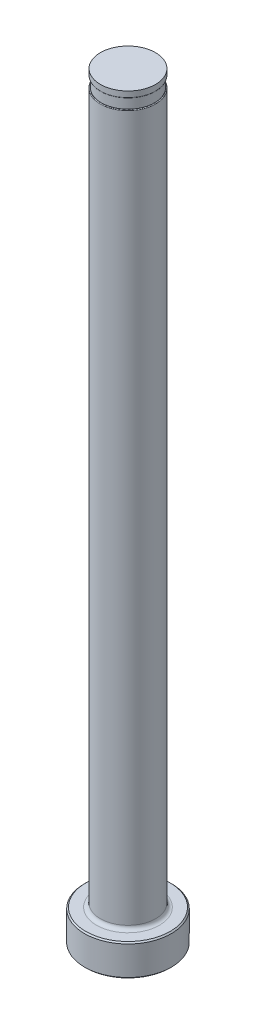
ISO-10303-21;
HEADER;
FILE_DESCRIPTION(('STEP AP214'),'2;1');
FILE_NAME('part.step','',(''),(''),'','','');
FILE_SCHEMA(('AUTOMOTIVE_DESIGN { 1 0 10303 214 1 1 1 1 }'));
ENDSEC;
DATA;
#1=APPLICATION_CONTEXT('core data for automotive mechanical design processes');
#2=APPLICATION_PROTOCOL_DEFINITION('international standard','automotive_design',2000,#1);
#3=PRODUCT_CONTEXT('',#1,'mechanical');
#4=PRODUCT('Part','Part','',(#3));
#5=PRODUCT_RELATED_PRODUCT_CATEGORY('part','',(#4));
#6=PRODUCT_DEFINITION_FORMATION('','',#4);
#7=PRODUCT_DEFINITION_CONTEXT('part definition',#1,'design');
#8=PRODUCT_DEFINITION('design','',#6,#7);
#9=PRODUCT_DEFINITION_SHAPE('','',#8);
#10=(LENGTH_UNIT() NAMED_UNIT(*) SI_UNIT(.MILLI.,.METRE.));
#11=(NAMED_UNIT(*) PLANE_ANGLE_UNIT() SI_UNIT($,.RADIAN.));
#12=(NAMED_UNIT(*) SI_UNIT($,.STERADIAN.) SOLID_ANGLE_UNIT());
#13=UNCERTAINTY_MEASURE_WITH_UNIT(LENGTH_MEASURE(1.E-05),#10,'distance_accuracy_value','');
#14=(GEOMETRIC_REPRESENTATION_CONTEXT(3) GLOBAL_UNCERTAINTY_ASSIGNED_CONTEXT((#13)) GLOBAL_UNIT_ASSIGNED_CONTEXT((#10,
#11,#12)) REPRESENTATION_CONTEXT('',''));
#15=CARTESIAN_POINT('',(0.,0.,0.));
#16=DIRECTION('',(0.,0.,1.));
#17=DIRECTION('',(1.,0.,0.));
#18=AXIS2_PLACEMENT_3D('',#15,#16,#17);
#19=CARTESIAN_POINT('',(-5.55624999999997,151.13,0.));
#20=DIRECTION('',(0.,1.,0.));
#21=DIRECTION('',(0.,0.,1.));
#22=AXIS2_PLACEMENT_3D('',#19,#20,#21);
#23=PLANE('',#22);
#24=CARTESIAN_POINT('',(0.,151.13,0.));
#25=DIRECTION('',(0.,1.,0.));
#26=DIRECTION('',(0.,0.,1.));
#27=AXIS2_PLACEMENT_3D('',#24,#25,#26);
#28=CIRCLE('',#27,5.41654999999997);
#29=CARTESIAN_POINT('',(0.,151.13,5.41654999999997));
#30=VERTEX_POINT('',#29);
#31=EDGE_CURVE('E11',#30,#30,#28,.F.);
#32=ORIENTED_EDGE('',*,*,#31,.T.);
#33=EDGE_LOOP('',(#32));
#34=FACE_BOUND('',#33,.T.);
#35=CARTESIAN_POINT('',(0.,151.13,0.));
#36=DIRECTION('',(0.,1.,0.));
#37=DIRECTION('',(0.,0.,1.));
#38=AXIS2_PLACEMENT_3D('',#35,#36,#37);
#39=CIRCLE('',#38,5.35304999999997);
#40=CARTESIAN_POINT('',(0.,151.13,5.35304999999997));
#41=VERTEX_POINT('',#40);
#42=EDGE_CURVE('E78',#41,#41,#39,.T.);
#43=ORIENTED_EDGE('',*,*,#42,.T.);
#44=EDGE_LOOP('',(#43));
#45=FACE_BOUND('',#44,.T.);
#46=ADVANCED_FACE('F36',(#34,#45),#23,.F.);
#47=CARTESIAN_POINT('',(0.,259.958771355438,0.));
#48=DIRECTION('',(0.,1.,0.));
#49=DIRECTION('',(0.,0.,1.));
#50=AXIS2_PLACEMENT_3D('',#47,#48,#49);
#51=CYLINDRICAL_SURFACE('',#50,5.55624999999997);
#52=DIRECTION('',(0.,1.,0.));
#53=VECTOR('',#52,1.);
#54=CARTESIAN_POINT('',(-5.35304999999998,259.958771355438,-1.48888205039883));
#55=LINE('',#54,#53);
#56=CARTESIAN_POINT('',(-5.35304999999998,148.971,-1.48888205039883));
#57=VERTEX_POINT('',#56);
#58=CARTESIAN_POINT('',(-5.35304999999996,86.614,-1.48888205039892));
#59=VERTEX_POINT('',#58);
#60=EDGE_CURVE('E73',#57,#59,#55,.F.);
#61=ORIENTED_EDGE('',*,*,#60,.F.);
#62=CARTESIAN_POINT('',(0.,148.971,0.));
#63=DIRECTION('',(0.,-1.,0.));
#64=DIRECTION('',(0.,0.,-1.));
#65=AXIS2_PLACEMENT_3D('',#62,#63,#64);
#66=CIRCLE('',#65,5.55624999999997);
#67=CARTESIAN_POINT('',(-5.35304999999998,148.971,1.48888205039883));
#68=VERTEX_POINT('',#67);
#69=EDGE_CURVE('E51',#57,#68,#66,.T.);
#70=ORIENTED_EDGE('',*,*,#69,.T.);
#71=DIRECTION('',(0.,1.,0.));
#72=VECTOR('',#71,1.);
#73=CARTESIAN_POINT('',(-5.35304999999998,259.958771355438,1.48888205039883));
#74=LINE('',#73,#72);
#75=CARTESIAN_POINT('',(-5.35304999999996,86.614,1.48888205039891));
#76=VERTEX_POINT('',#75);
#77=EDGE_CURVE('E84',#76,#68,#74,.T.);
#78=ORIENTED_EDGE('',*,*,#77,.F.);
#79=CARTESIAN_POINT('',(-5.35304999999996,86.614,-1.48888205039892));
#80=CARTESIAN_POINT('',(-5.35304712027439,86.5859400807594,-1.48888592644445));
#81=CARTESIAN_POINT('',(-5.35342246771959,86.557898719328,-1.48754344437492));
#82=CARTESIAN_POINT('',(-5.35490012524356,86.5021072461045,-1.48221807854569));
#83=CARTESIAN_POINT('',(-5.3560019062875,86.4743569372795,-1.47823711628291));
#84=CARTESIAN_POINT('',(-5.36032637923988,86.3923774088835,-1.46251079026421));
#85=CARTESIAN_POINT('',(-5.36456936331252,86.338885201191,-1.44697968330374));
#86=CARTESIAN_POINT('',(-5.37522073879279,86.2358696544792,-1.40688871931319));
#87=CARTESIAN_POINT('',(-5.38162399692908,86.1863372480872,-1.38235025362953));
#88=CARTESIAN_POINT('',(-5.39588416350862,86.0920393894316,-1.3255962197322));
#89=CARTESIAN_POINT('',(-5.40374399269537,86.0472838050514,-1.29336518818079));
#90=CARTESIAN_POINT('',(-5.42234104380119,85.9520810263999,-1.21335067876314));
#91=CARTESIAN_POINT('',(-5.43329059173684,85.9032435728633,-1.16370716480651));
#92=CARTESIAN_POINT('',(-5.45504519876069,85.8143973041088,-1.05705847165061));
#93=CARTESIAN_POINT('',(-5.46585002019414,85.7744016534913,-1.0000425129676));
#94=CARTESIAN_POINT('',(-5.48941062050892,85.6922379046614,-0.862814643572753));
#95=CARTESIAN_POINT('',(-5.50177933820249,85.6530172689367,-0.780775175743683));
#96=CARTESIAN_POINT('',(-5.52319531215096,85.5880184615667,-0.61119833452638));
#97=CARTESIAN_POINT('',(-5.53224012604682,85.5622501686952,-0.523656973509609));
#98=CARTESIAN_POINT('',(-5.54633656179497,85.5229210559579,-0.343981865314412));
#99=CARTESIAN_POINT('',(-5.551315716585,85.5095811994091,-0.251794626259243));
#100=CARTESIAN_POINT('',(-5.55663041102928,85.4953656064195,-0.0663077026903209));
#101=CARTESIAN_POINT('',(-5.5569631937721,85.4944972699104,0.0269926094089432));
#102=CARTESIAN_POINT('',(-5.55261816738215,85.5060778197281,0.228128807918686));
#103=CARTESIAN_POINT('',(-5.5471061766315,85.5207433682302,0.335828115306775));
#104=CARTESIAN_POINT('',(-5.53028051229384,85.5677503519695,0.546872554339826));
#105=CARTESIAN_POINT('',(-5.51897217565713,85.60007552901,0.650221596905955));
#106=CARTESIAN_POINT('',(-5.49592210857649,85.6717771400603,0.81966257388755));
#107=CARTESIAN_POINT('',(-5.48524552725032,85.7064328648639,0.88790475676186));
#108=CARTESIAN_POINT('',(-5.46261932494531,85.7860662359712,1.01785270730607));
#109=CARTESIAN_POINT('',(-5.45067176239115,85.8310273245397,1.07956873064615));
#110=CARTESIAN_POINT('',(-5.42934912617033,85.9209408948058,1.18161350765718));
#111=CARTESIAN_POINT('',(-5.41996423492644,85.9638853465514,1.22370530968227));
#112=CARTESIAN_POINT('',(-5.40207756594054,86.0562163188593,1.30039205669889));
#113=CARTESIAN_POINT('',(-5.3935749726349,86.1055967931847,1.33499395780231));
#114=CARTESIAN_POINT('',(-5.37957377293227,86.2020291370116,1.39024779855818));
#115=CARTESIAN_POINT('',(-5.37381465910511,86.2482834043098,1.4122235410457));
#116=CARTESIAN_POINT('',(-5.36419527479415,86.3439194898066,1.44833565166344));
#117=CARTESIAN_POINT('',(-5.36033174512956,86.3932957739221,1.46248548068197));
#118=CARTESIAN_POINT('',(-5.3561211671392,86.4715749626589,1.47780624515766));
#119=CARTESIAN_POINT('',(-5.35497463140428,86.49988137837,1.48194947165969));
#120=CARTESIAN_POINT('',(-5.35343719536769,86.5567860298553,1.48749027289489));
#121=CARTESIAN_POINT('',(-5.35304641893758,86.5853843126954,1.4888873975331));
#122=CARTESIAN_POINT('',(-5.35304999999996,86.614,1.48888205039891));
#123=B_SPLINE_CURVE_WITH_KNOTS('',3,(#79,#80,#81,#82,#83,#84,#85,#86,#87,#88,#89,#90,#91,#92,
#93,#94,#95,#96,#97,#98,#99,#100,#101,#102,#103,#104,#105,#106,#107,#108,#109,#110,#111,#112,
#113,#114,#115,#116,#117,#118,#119,#120,#121,#122),.UNSPECIFIED.,.F.,.F.,(4,2,2,2,2,2,2,2,2,2,2,
2,2,2,2,2,2,2,2,2,2,4),(0.,0.0841097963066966,0.168158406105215,0.334679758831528,
0.50080817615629,0.667273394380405,0.87762078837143,1.0882792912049,1.36213137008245,
1.63618427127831,1.91502141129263,2.19402399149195,2.51897339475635,2.84362413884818,
3.07466463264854,3.30533648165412,3.48723774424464,3.66896933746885,3.82292542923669,
3.97661588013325,4.06237930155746,4.14815677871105),.UNSPECIFIED.);
#124=EDGE_CURVE('E81',#59,#76,#123,.T.);
#125=ORIENTED_EDGE('',*,*,#124,.F.);
#126=EDGE_LOOP('',(#61,#70,#78,#125));
#127=FACE_BOUND('',#126,.T.);
#128=CARTESIAN_POINT('',(0.,7.11200000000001,0.));
#129=DIRECTION('',(0.,1.,0.));
#130=DIRECTION('',(0.,0.,1.));
#131=AXIS2_PLACEMENT_3D('',#128,#129,#130);
#132=CIRCLE('',#131,5.55624999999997);
#133=CARTESIAN_POINT('',(0.,7.11200000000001,5.55624999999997));
#134=VERTEX_POINT('',#133);
#135=EDGE_CURVE('E116',#134,#134,#132,.T.);
#136=ORIENTED_EDGE('',*,*,#135,.T.);
#137=EDGE_LOOP('',(#136));
#138=FACE_BOUND('',#137,.T.);
#139=ADVANCED_FACE('F82',(#127,#138),#51,.T.);
#140=CARTESIAN_POINT('',(0.,0.,0.));
#141=DIRECTION('',(0.,-1.,0.));
#142=DIRECTION('',(0.,0.,-1.));
#143=AXIS2_PLACEMENT_3D('',#140,#141,#142);
#144=PLANE('',#143);
#145=CARTESIAN_POINT('',(0.,0.,0.));
#146=DIRECTION('',(0.,-1.,0.));
#147=DIRECTION('',(0.,0.,-1.));
#148=AXIS2_PLACEMENT_3D('',#145,#146,#147);
#149=CIRCLE('',#148,8.47089999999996);
#150=CARTESIAN_POINT('',(0.,0.,-8.47089999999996));
#151=VERTEX_POINT('',#150);
#152=EDGE_CURVE('E113',#151,#151,#149,.T.);
#153=ORIENTED_EDGE('',*,*,#152,.T.);
#154=EDGE_LOOP('',(#153));
#155=FACE_BOUND('',#154,.T.);
#156=ADVANCED_FACE('F192',(#155),#144,.T.);
#157=CARTESIAN_POINT('',(0.,259.958771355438,0.));
#158=DIRECTION('',(0.,1.,0.));
#159=DIRECTION('',(0.,0.,1.));
#160=AXIS2_PLACEMENT_3D('',#157,#158,#159);
#161=CYLINDRICAL_SURFACE('',#160,8.72489999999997);
#162=CARTESIAN_POINT('',(0.,6.09600000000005,0.));
#163=DIRECTION('',(0.,1.,0.));
#164=DIRECTION('',(0.,0.,1.));
#165=AXIS2_PLACEMENT_3D('',#162,#163,#164);
#166=CIRCLE('',#165,8.72489999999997);
#167=CARTESIAN_POINT('',(0.,6.09600000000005,8.72489999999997));
#168=VERTEX_POINT('',#167);
#169=EDGE_CURVE('E110',#168,#168,#166,.F.);
#170=ORIENTED_EDGE('',*,*,#169,.T.);
#171=EDGE_LOOP('',(#170));
#172=FACE_BOUND('',#171,.T.);
#173=CARTESIAN_POINT('',(0.,0.254000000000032,0.));
#174=DIRECTION('',(0.,-1.,0.));
#175=DIRECTION('',(0.,0.,-1.));
#176=AXIS2_PLACEMENT_3D('',#173,#174,#175);
#177=CIRCLE('',#176,8.72489999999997);
#178=CARTESIAN_POINT('',(0.,0.254000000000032,-8.72489999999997));
#179=VERTEX_POINT('',#178);
#180=EDGE_CURVE('E107',#179,#179,#177,.F.);
#181=ORIENTED_EDGE('',*,*,#180,.T.);
#182=EDGE_LOOP('',(#181));
#183=FACE_BOUND('',#182,.T.);
#184=ADVANCED_FACE('F195',(#172,#183),#161,.T.);
#185=CARTESIAN_POINT('',(-8.72489999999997,6.35,0.));
#186=DIRECTION('',(0.,1.,0.));
#187=DIRECTION('',(0.,0.,1.));
#188=AXIS2_PLACEMENT_3D('',#185,#186,#187);
#189=PLANE('',#188);
#190=CARTESIAN_POINT('',(0.,6.35,0.));
#191=DIRECTION('',(0.,1.,0.));
#192=DIRECTION('',(0.,0.,1.));
#193=AXIS2_PLACEMENT_3D('',#190,#191,#192);
#194=CIRCLE('',#193,6.31824999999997);
#195=CARTESIAN_POINT('',(0.,6.35,6.31824999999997));
#196=VERTEX_POINT('',#195);
#197=EDGE_CURVE('E87',#196,#196,#194,.F.);
#198=ORIENTED_EDGE('',*,*,#197,.T.);
#199=EDGE_LOOP('',(#198));
#200=FACE_BOUND('',#199,.T.);
#201=CARTESIAN_POINT('',(0.,6.35,0.));
#202=DIRECTION('',(0.,1.,0.));
#203=DIRECTION('',(0.,0.,1.));
#204=AXIS2_PLACEMENT_3D('',#201,#202,#203);
#205=CIRCLE('',#204,8.47090000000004);
#206=CARTESIAN_POINT('',(0.,6.35,8.47090000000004));
#207=VERTEX_POINT('',#206);
#208=EDGE_CURVE('E104',#207,#207,#205,.T.);
#209=ORIENTED_EDGE('',*,*,#208,.T.);
#210=EDGE_LOOP('',(#209));
#211=FACE_BOUND('',#210,.T.);
#212=ADVANCED_FACE('F190',(#200,#211),#189,.T.);
#213=CARTESIAN_POINT('',(0.,6.35000000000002,0.));
#214=DIRECTION('',(0.,-1.,0.));
#215=DIRECTION('',(0.,0.,-1.));
#216=AXIS2_PLACEMENT_3D('',#213,#214,#215);
#217=CONICAL_SURFACE('',#216,8.47090000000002,0.785398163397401);
#218=ORIENTED_EDGE('',*,*,#169,.F.);
#219=EDGE_LOOP('',(#218));
#220=FACE_BOUND('',#219,.T.);
#221=ORIENTED_EDGE('',*,*,#208,.F.);
#222=EDGE_LOOP('',(#221));
#223=FACE_BOUND('',#222,.T.);
#224=ADVANCED_FACE('F186',(#220,#223),#217,.T.);
#225=CARTESIAN_POINT('',(0.,0.254000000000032,0.));
#226=DIRECTION('',(0.,1.,0.));
#227=DIRECTION('',(0.,0.,1.));
#228=AXIS2_PLACEMENT_3D('',#225,#226,#227);
#229=CONICAL_SURFACE('',#228,8.72489999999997,0.785398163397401);
#230=ORIENTED_EDGE('',*,*,#152,.F.);
#231=EDGE_LOOP('',(#230));
#232=FACE_BOUND('',#231,.T.);
#233=ORIENTED_EDGE('',*,*,#180,.F.);
#234=EDGE_LOOP('',(#233));
#235=FACE_BOUND('',#234,.T.);
#236=ADVANCED_FACE('F182',(#232,#235),#229,.T.);
#237=CARTESIAN_POINT('',(0.,7.11200000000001,0.));
#238=DIRECTION('',(0.,1.,0.));
#239=DIRECTION('',(0.,0.,1.));
#240=AXIS2_PLACEMENT_3D('',#237,#238,#239);
#241=TOROIDAL_SURFACE('',#240,6.31824999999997,0.762);
#242=ORIENTED_EDGE('',*,*,#197,.F.);
#243=EDGE_LOOP('',(#242));
#244=FACE_BOUND('',#243,.T.);
#245=ORIENTED_EDGE('',*,*,#135,.F.);
#246=EDGE_LOOP('',(#245));
#247=FACE_BOUND('',#246,.T.);
#248=ADVANCED_FACE('F147',(#244,#247),#241,.F.);
#249=CARTESIAN_POINT('',(-5.55624999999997,149.098,0.));
#250=DIRECTION('',(0.,-1.,0.));
#251=DIRECTION('',(0.,0.,-1.));
#252=AXIS2_PLACEMENT_3D('',#249,#250,#251);
#253=PLANE('',#252);
#254=DIRECTION('',(0.,0.,1.));
#255=VECTOR('',#254,1.);
#256=CARTESIAN_POINT('',(-5.35304999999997,149.098,0.));
#257=LINE('',#256,#255);
#258=CARTESIAN_POINT('',(-5.35304999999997,149.098,0.));
#259=VERTEX_POINT('',#258);
#260=CARTESIAN_POINT('',(-5.35304999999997,149.098,0.906427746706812));
#261=VERTEX_POINT('',#260);
#262=EDGE_CURVE('E90',#259,#261,#257,.T.);
#263=ORIENTED_EDGE('',*,*,#262,.T.);
#264=CARTESIAN_POINT('',(0.,149.098,0.));
#265=DIRECTION('',(0.,-1.,0.));
#266=DIRECTION('',(0.,0.,-1.));
#267=AXIS2_PLACEMENT_3D('',#264,#265,#266);
#268=CIRCLE('',#267,5.42924999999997);
#269=CARTESIAN_POINT('',(-5.35304999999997,149.098,-0.906427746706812));
#270=VERTEX_POINT('',#269);
#271=EDGE_CURVE('E86',#261,#270,#268,.F.);
#272=ORIENTED_EDGE('',*,*,#271,.T.);
#273=EDGE_CURVE('E79',#270,#259,#257,.T.);
#274=ORIENTED_EDGE('',*,*,#273,.T.);
#275=CARTESIAN_POINT('',(0.,149.098,0.));
#276=DIRECTION('',(0.,1.,0.));
#277=DIRECTION('',(0.,0.,1.));
#278=AXIS2_PLACEMENT_3D('',#275,#276,#277);
#279=CIRCLE('',#278,5.35304999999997);
#280=EDGE_CURVE('E101',#259,#259,#279,.T.);
#281=ORIENTED_EDGE('',*,*,#280,.F.);
#282=EDGE_LOOP('',(#263,#272,#274,#281));
#283=FACE_BOUND('',#282,.T.);
#284=ADVANCED_FACE('F144',(#283),#253,.F.);
#285=CARTESIAN_POINT('',(0.,153.448281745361,0.));
#286=DIRECTION('',(0.,1.,0.));
#287=DIRECTION('',(0.,0.,1.));
#288=AXIS2_PLACEMENT_3D('',#285,#286,#287);
#289=CYLINDRICAL_SURFACE('',#288,5.35304999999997);
#290=ORIENTED_EDGE('',*,*,#42,.F.);
#291=EDGE_LOOP('',(#290));
#292=FACE_BOUND('',#291,.T.);
#293=ORIENTED_EDGE('',*,*,#280,.T.);
#294=EDGE_LOOP('',(#293));
#295=FACE_BOUND('',#294,.T.);
#296=ADVANCED_FACE('F141',(#292,#295),#289,.T.);
#297=CARTESIAN_POINT('',(-5.35304999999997,150.114,-8.72489999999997));
#298=DIRECTION('',(1.,0.,0.));
#299=DIRECTION('',(0.,1.,0.));
#300=AXIS2_PLACEMENT_3D('',#297,#298,#299);
#301=PLANE('',#300);
#302=ORIENTED_EDGE('',*,*,#273,.F.);
#303=CARTESIAN_POINT('',(-5.35304999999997,149.098,-0.906427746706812));
#304=CARTESIAN_POINT('',(-5.35304999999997,149.097997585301,-0.927323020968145));
#305=CARTESIAN_POINT('',(-5.35304999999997,149.097856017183,-0.94821957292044));
#306=CARTESIAN_POINT('',(-5.35304999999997,149.097220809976,-0.990022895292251));
#307=CARTESIAN_POINT('',(-5.35304999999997,149.09672690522,-1.01092966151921));
#308=CARTESIAN_POINT('',(-5.35304999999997,149.095293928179,-1.05329459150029));
#309=CARTESIAN_POINT('',(-5.35304999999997,149.094343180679,-1.07475238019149));
#310=CARTESIAN_POINT('',(-5.35304999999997,149.091886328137,-1.11762595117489));
#311=CARTESIAN_POINT('',(-5.35304999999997,149.090380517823,-1.13904174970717));
#312=CARTESIAN_POINT('',(-5.35304999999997,149.086668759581,-1.18182014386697));
#313=CARTESIAN_POINT('',(-5.35304999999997,149.084462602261,-1.20318272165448));
#314=CARTESIAN_POINT('',(-5.35304999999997,149.079137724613,-1.24583267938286));
#315=CARTESIAN_POINT('',(-5.35304999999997,149.076017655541,-1.26711990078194));
#316=CARTESIAN_POINT('',(-5.35304999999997,149.068562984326,-1.30920547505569));
#317=CARTESIAN_POINT('',(-5.35304999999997,149.064244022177,-1.33000661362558));
#318=CARTESIAN_POINT('',(-5.35304999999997,149.053803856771,-1.37114198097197));
#319=CARTESIAN_POINT('',(-5.35304999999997,149.047688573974,-1.39147751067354));
#320=CARTESIAN_POINT('',(-5.35304999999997,149.037778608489,-1.41655009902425));
#321=CARTESIAN_POINT('',(-5.35304999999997,149.035524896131,-1.4218879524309));
#322=CARTESIAN_POINT('',(-5.35304999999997,149.030682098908,-1.43243190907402));
#323=CARTESIAN_POINT('',(-5.35304999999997,149.028092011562,-1.43763756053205));
#324=CARTESIAN_POINT('',(-5.35304999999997,149.022182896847,-1.44837668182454));
#325=CARTESIAN_POINT('',(-5.35304999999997,149.018815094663,-1.45388357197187));
#326=CARTESIAN_POINT('',(-5.35304999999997,149.011355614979,-1.4643862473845));
#327=CARTESIAN_POINT('',(-5.35304999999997,149.007267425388,-1.46938432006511));
#328=CARTESIAN_POINT('',(-5.35304999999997,149.000750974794,-1.47569818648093));
#329=CARTESIAN_POINT('',(-5.35304999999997,148.998754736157,-1.47745487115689));
#330=CARTESIAN_POINT('',(-5.35304999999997,148.994555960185,-1.4807071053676));
#331=CARTESIAN_POINT('',(-5.35304999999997,148.992353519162,-1.48220277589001));
#332=CARTESIAN_POINT('',(-5.35304999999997,148.988086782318,-1.48462572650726));
#333=CARTESIAN_POINT('',(-5.35304999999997,148.986052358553,-1.48560484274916));
#334=CARTESIAN_POINT('',(-5.35304999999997,148.981851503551,-1.48721324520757));
#335=CARTESIAN_POINT('',(-5.35304999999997,148.979685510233,-1.48784362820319));
#336=CARTESIAN_POINT('',(-5.35304999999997,148.976414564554,-1.48846795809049));
#337=CARTESIAN_POINT('',(-5.35304999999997,148.975338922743,-1.48862246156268));
#338=CARTESIAN_POINT('',(-5.35304999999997,148.973175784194,-1.48882979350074));
#339=CARTESIAN_POINT('',(-5.35304999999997,148.972088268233,-1.48888242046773));
#340=CARTESIAN_POINT('',(-5.35304999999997,148.971,-1.48888205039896));
#341=B_SPLINE_CURVE_WITH_KNOTS('',3,(#303,#304,#305,#306,#307,#308,#309,#310,#311,#312,#313,
#314,#315,#316,#317,#318,#319,#320,#321,#322,#323,#324,#325,#326,#327,#328,#329,#330,#331,#332,
#333,#334,#335,#336,#337,#338,#339,#340),.UNSPECIFIED.,.F.,.F.,(4,2,2,2,2,2,2,2,2,2,2,2,2,2,2,2,
2,2,4),(0.,0.06268730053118,0.125421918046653,0.189852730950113,0.254249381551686,
0.318665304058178,0.383176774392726,0.446883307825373,0.510382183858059,0.527756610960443,
0.54518406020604,0.564521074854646,0.583766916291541,0.591729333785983,0.599688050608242,
0.606437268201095,0.61316513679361,0.616420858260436,0.619683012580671),.UNSPECIFIED.);
#342=EDGE_CURVE('E59',#270,#57,#341,.T.);
#343=ORIENTED_EDGE('',*,*,#342,.T.);
#344=ORIENTED_EDGE('',*,*,#60,.T.);
#345=DIRECTION('',(0.,0.,1.));
#346=VECTOR('',#345,1.);
#347=CARTESIAN_POINT('',(-5.35304999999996,86.614,-8.72489999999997));
#348=LINE('',#347,#346);
#349=EDGE_CURVE('E77',#59,#76,#348,.T.);
#350=ORIENTED_EDGE('',*,*,#349,.T.);
#351=ORIENTED_EDGE('',*,*,#77,.T.);
#352=CARTESIAN_POINT('',(-5.35304999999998,148.971,1.48888205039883));
#353=CARTESIAN_POINT('',(-5.35304999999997,148.973315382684,1.48889020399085));
#354=CARTESIAN_POINT('',(-5.35304999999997,148.975618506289,1.48864616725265));
#355=CARTESIAN_POINT('',(-5.35304999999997,148.980103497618,1.48773344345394));
#356=CARTESIAN_POINT('',(-5.35304999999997,148.982286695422,1.48707143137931));
#357=CARTESIAN_POINT('',(-5.35304999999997,148.987009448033,1.48520073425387));
#358=CARTESIAN_POINT('',(-5.35304999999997,148.989511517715,1.4838999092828));
#359=CARTESIAN_POINT('',(-5.35304999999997,148.99428827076,1.48091465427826));
#360=CARTESIAN_POINT('',(-5.35304999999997,148.996561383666,1.47922780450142));
#361=CARTESIAN_POINT('',(-5.35304999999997,149.002524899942,1.47421628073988));
#362=CARTESIAN_POINT('',(-5.35304999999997,149.005983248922,1.47061948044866));
#363=CARTESIAN_POINT('',(-5.35304999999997,149.012372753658,1.46299694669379));
#364=CARTESIAN_POINT('',(-5.35304999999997,149.015302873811,1.45897039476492));
#365=CARTESIAN_POINT('',(-5.35304999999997,149.02218028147,1.44851786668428));
#366=CARTESIAN_POINT('',(-5.35304999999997,149.02587230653,1.44192584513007));
#367=CARTESIAN_POINT('',(-5.35304999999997,149.032640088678,1.42842790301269));
#368=CARTESIAN_POINT('',(-5.35304999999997,149.035714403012,1.42152129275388));
#369=CARTESIAN_POINT('',(-5.35304999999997,149.044282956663,1.40046246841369));
#370=CARTESIAN_POINT('',(-5.35304999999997,149.049087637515,1.38603333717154));
#371=CARTESIAN_POINT('',(-5.35304999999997,149.061626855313,1.34303383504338));
#372=CARTESIAN_POINT('',(-5.35304999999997,149.067813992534,1.31403988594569));
#373=CARTESIAN_POINT('',(-5.35304999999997,149.077934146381,1.25562656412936));
#374=CARTESIAN_POINT('',(-5.35304999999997,149.08186080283,1.22620622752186));
#375=CARTESIAN_POINT('',(-5.35304999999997,149.088178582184,1.16719231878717));
#376=CARTESIAN_POINT('',(-5.35304999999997,149.090569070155,1.13759868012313));
#377=CARTESIAN_POINT('',(-5.35304999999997,149.094250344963,1.07838180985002));
#378=CARTESIAN_POINT('',(-5.35304999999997,149.095542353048,1.04875864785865));
#379=CARTESIAN_POINT('',(-5.35304999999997,149.096983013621,1.00031217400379));
#380=CARTESIAN_POINT('',(-5.35304999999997,149.09737689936,0.98149542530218));
#381=CARTESIAN_POINT('',(-5.35304999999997,149.097884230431,0.943928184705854));
#382=CARTESIAN_POINT('',(-5.35304999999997,149.097998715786,0.925177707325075));
#383=CARTESIAN_POINT('',(-5.35304999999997,149.098,0.906427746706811));
#384=B_SPLINE_CURVE_WITH_KNOTS('',3,(#352,#353,#354,#355,#356,#357,#358,#359,#360,#361,#362,
#363,#364,#365,#366,#367,#368,#369,#370,#371,#372,#373,#374,#375,#376,#377,#378,#379,#380,#381,
#382,#383),.UNSPECIFIED.,.F.,.F.,(4,2,2,2,2,2,2,2,2,2,2,2,2,2,2,4),(0.,0.00691371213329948,
0.0137197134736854,0.0221318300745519,0.0305981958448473,0.0454833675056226,0.0603974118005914,
0.0830067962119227,0.105668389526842,0.151203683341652,0.23995736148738,0.328959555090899,
0.417998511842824,0.506938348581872,0.563399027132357,0.619649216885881),.UNSPECIFIED.);
#385=EDGE_CURVE('E172',#68,#261,#384,.T.);
#386=ORIENTED_EDGE('',*,*,#385,.T.);
#387=ORIENTED_EDGE('',*,*,#262,.F.);
#388=EDGE_LOOP('',(#302,#343,#344,#350,#351,#386,#387));
#389=FACE_BOUND('',#388,.T.);
#390=ADVANCED_FACE('F75',(#389),#301,.F.);
#391=CARTESIAN_POINT('',(-8.52804999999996,86.614,-8.72489999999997));
#392=DIRECTION('',(0.,0.,1.));
#393=DIRECTION('',(1.,0.,0.));
#394=AXIS2_PLACEMENT_3D('',#391,#392,#393);
#395=CYLINDRICAL_SURFACE('',#394,3.175);
#396=ORIENTED_EDGE('',*,*,#349,.F.);
#397=ORIENTED_EDGE('',*,*,#124,.T.);
#398=EDGE_LOOP('',(#396,#397));
#399=FACE_BOUND('',#398,.T.);
#400=ADVANCED_FACE('F89',(#399),#395,.F.);
#401=CARTESIAN_POINT('',(0.,152.687735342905,0.));
#402=DIRECTION('',(0.,1.,0.));
#403=DIRECTION('',(0.,0.,1.));
#404=AXIS2_PLACEMENT_3D('',#401,#402,#403);
#405=CYLINDRICAL_SURFACE('',#404,5.54354999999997);
#406=CARTESIAN_POINT('',(0.,151.257,0.));
#407=DIRECTION('',(0.,1.,0.));
#408=DIRECTION('',(0.,0.,1.));
#409=AXIS2_PLACEMENT_3D('',#406,#407,#408);
#410=CIRCLE('',#409,5.54354999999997);
#411=CARTESIAN_POINT('',(0.,151.257,5.54354999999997));
#412=VERTEX_POINT('',#411);
#413=EDGE_CURVE('E44',#412,#412,#410,.T.);
#414=ORIENTED_EDGE('',*,*,#413,.T.);
#415=EDGE_LOOP('',(#414));
#416=FACE_BOUND('',#415,.T.);
#417=CARTESIAN_POINT('',(0.,152.4,0.));
#418=DIRECTION('',(0.,1.,0.));
#419=DIRECTION('',(0.,0.,1.));
#420=AXIS2_PLACEMENT_3D('',#417,#418,#419);
#421=CIRCLE('',#420,5.54354999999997);
#422=CARTESIAN_POINT('',(0.,152.4,5.54354999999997));
#423=VERTEX_POINT('',#422);
#424=EDGE_CURVE('E91',#423,#423,#421,.T.);
#425=ORIENTED_EDGE('',*,*,#424,.F.);
#426=EDGE_LOOP('',(#425));
#427=FACE_BOUND('',#426,.T.);
#428=ADVANCED_FACE('F135',(#416,#427),#405,.T.);
#429=CARTESIAN_POINT('',(-5.55624999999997,152.4,0.));
#430=DIRECTION('',(0.,1.,0.));
#431=DIRECTION('',(0.,0.,1.));
#432=AXIS2_PLACEMENT_3D('',#429,#430,#431);
#433=PLANE('',#432);
#434=ORIENTED_EDGE('',*,*,#424,.T.);
#435=EDGE_LOOP('',(#434));
#436=FACE_BOUND('',#435,.T.);
#437=ADVANCED_FACE('F149',(#436),#433,.T.);
#438=CARTESIAN_POINT('',(0.,148.971,0.));
#439=DIRECTION('',(0.,-1.,0.));
#440=DIRECTION('',(0.,0.,-1.));
#441=AXIS2_PLACEMENT_3D('',#438,#439,#440);
#442=TOROIDAL_SURFACE('',#441,5.42924999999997,0.127);
#443=ORIENTED_EDGE('',*,*,#385,.F.);
#444=ORIENTED_EDGE('',*,*,#69,.F.);
#445=ORIENTED_EDGE('',*,*,#342,.F.);
#446=ORIENTED_EDGE('',*,*,#271,.F.);
#447=EDGE_LOOP('',(#443,#444,#445,#446));
#448=FACE_BOUND('',#447,.T.);
#449=ADVANCED_FACE('F151',(#448),#442,.T.);
#450=CARTESIAN_POINT('',(0.,151.257,0.));
#451=DIRECTION('',(0.,1.,0.));
#452=DIRECTION('',(0.,0.,1.));
#453=AXIS2_PLACEMENT_3D('',#450,#451,#452);
#454=TOROIDAL_SURFACE('',#453,5.41654999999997,0.127);
#455=ORIENTED_EDGE('',*,*,#31,.F.);
#456=EDGE_LOOP('',(#455));
#457=FACE_BOUND('',#456,.T.);
#458=ORIENTED_EDGE('',*,*,#413,.F.);
#459=EDGE_LOOP('',(#458));
#460=FACE_BOUND('',#459,.T.);
#461=ADVANCED_FACE('F38',(#457,#460),#454,.T.);
#462=CLOSED_SHELL('',(#46,#139,#156,#184,#212,#224,#236,#248,#284,#296,#390,#400,#428,#437,#449,#461));
#463=MANIFOLD_SOLID_BREP('B2',#462);
#464=ADVANCED_BREP_SHAPE_REPRESENTATION('',(#18,#463),#14);
#465=SHAPE_DEFINITION_REPRESENTATION(#9,#464);
ENDSEC;
END-ISO-10303-21;
